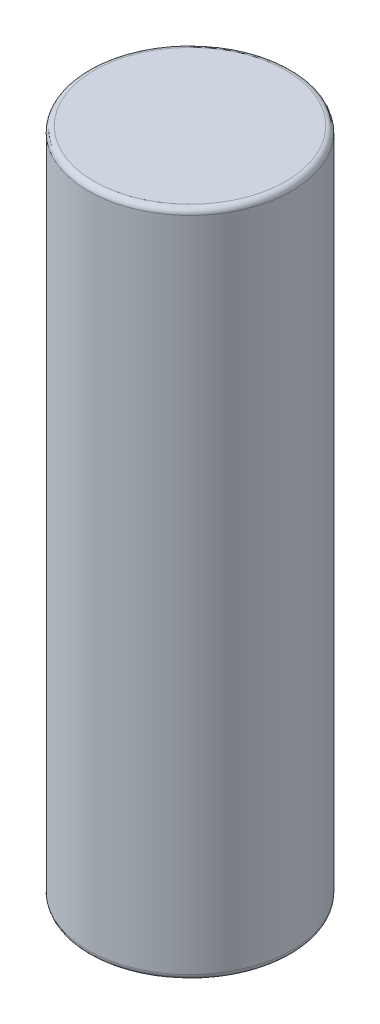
from build123d import *

# Parameters (mm, degrees)
SKETCH1_R           = 10.75
BOSS_EXTRUDE1_DEPTH = 70.7
FILLET1_R           = 0.6


with BuildPart() as part:
    # Sketch1 → Boss-Extrude1 (new body)
    with BuildSketch(Plane(origin=(0, 0, 0), x_dir=(1, 0, 0), z_dir=(0, 1, 0))):
        with Locations(Location((0, 0, 0), (0, 0, 270))):
            Circle(SKETCH1_R)
    extrude(amount=BOSS_EXTRUDE1_DEPTH)

    # Fillet1
    fillet1_edges = [part.edges().sort_by_distance(p)[0] for p in [
        (0, 0, -10.75),
        (0, 70.7, -10.75),
    ]]
    fillet(fillet1_edges, radius=FILLET1_R)


solid = part.part
